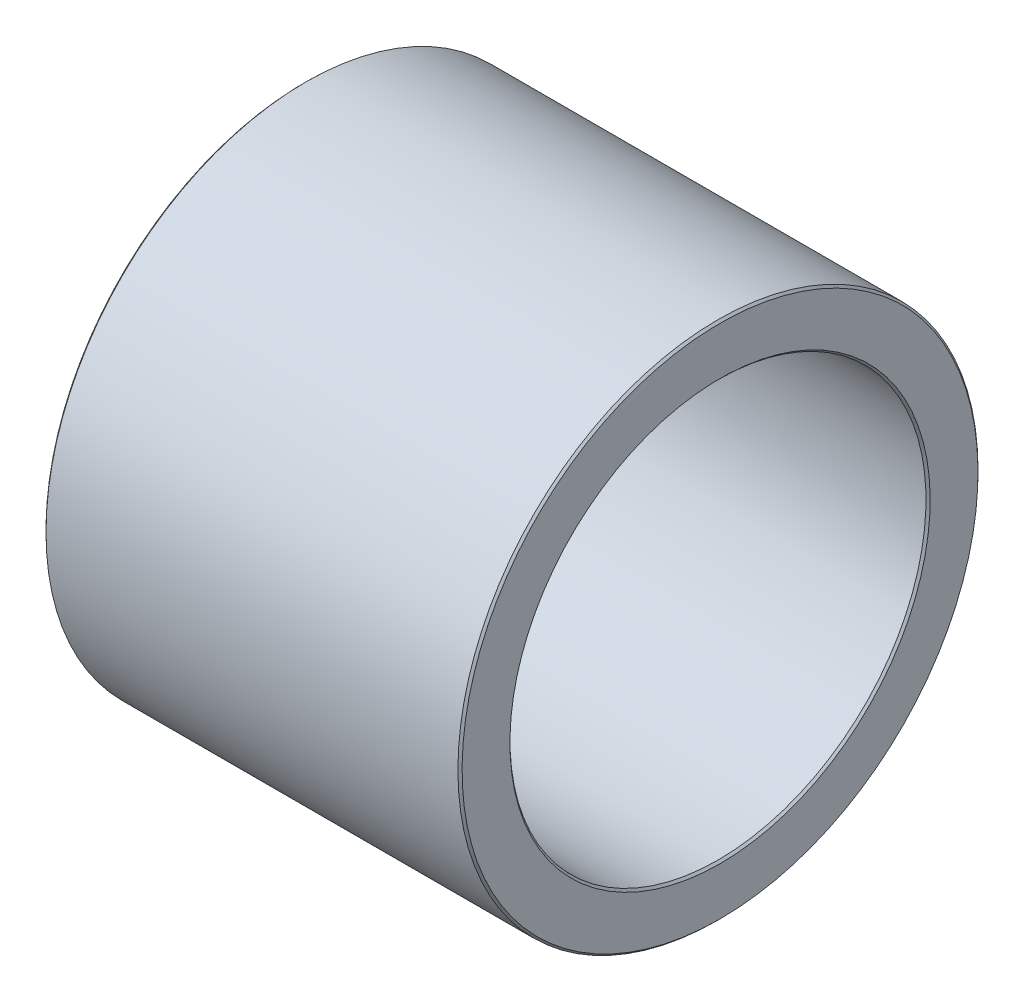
ISO-10303-21;
HEADER;
FILE_DESCRIPTION(('STEP AP214'),'2;1');
FILE_NAME('part.step','',(''),(''),'','','');
FILE_SCHEMA(('AUTOMOTIVE_DESIGN { 1 0 10303 214 1 1 1 1 }'));
ENDSEC;
DATA;
#1=APPLICATION_CONTEXT('core data for automotive mechanical design processes');
#2=APPLICATION_PROTOCOL_DEFINITION('international standard','automotive_design',2000,#1);
#3=PRODUCT_CONTEXT('',#1,'mechanical');
#4=PRODUCT('Part','Part','',(#3));
#5=PRODUCT_RELATED_PRODUCT_CATEGORY('part','',(#4));
#6=PRODUCT_DEFINITION_FORMATION('','',#4);
#7=PRODUCT_DEFINITION_CONTEXT('part definition',#1,'design');
#8=PRODUCT_DEFINITION('design','',#6,#7);
#9=PRODUCT_DEFINITION_SHAPE('','',#8);
#10=(LENGTH_UNIT() NAMED_UNIT(*) SI_UNIT(.MILLI.,.METRE.));
#11=(NAMED_UNIT(*) PLANE_ANGLE_UNIT() SI_UNIT($,.RADIAN.));
#12=(NAMED_UNIT(*) SI_UNIT($,.STERADIAN.) SOLID_ANGLE_UNIT());
#13=UNCERTAINTY_MEASURE_WITH_UNIT(LENGTH_MEASURE(1.E-05),#10,'distance_accuracy_value','');
#14=(GEOMETRIC_REPRESENTATION_CONTEXT(3) GLOBAL_UNCERTAINTY_ASSIGNED_CONTEXT((#13)) GLOBAL_UNIT_ASSIGNED_CONTEXT((#10,
#11,#12)) REPRESENTATION_CONTEXT('',''));
#15=CARTESIAN_POINT('',(0.,0.,0.));
#16=DIRECTION('',(0.,0.,1.));
#17=DIRECTION('',(1.,0.,0.));
#18=AXIS2_PLACEMENT_3D('',#15,#16,#17);
#19=CARTESIAN_POINT('',(0.,-45.,0.));
#20=DIRECTION('',(-1.,0.,0.));
#21=DIRECTION('',(0.,1.,0.));
#22=AXIS2_PLACEMENT_3D('',#19,#20,#21);
#23=PLANE('',#22);
#24=CARTESIAN_POINT('',(0.,0.,0.));
#25=DIRECTION('',(1.,0.,0.));
#26=DIRECTION('',(0.,-1.,0.));
#27=AXIS2_PLACEMENT_3D('',#24,#25,#26);
#28=CIRCLE('',#27,40.4);
#29=CARTESIAN_POINT('',(0.,-40.4,0.));
#30=VERTEX_POINT('',#29);
#31=EDGE_CURVE('E9',#30,#30,#28,.T.);
#32=ORIENTED_EDGE('',*,*,#31,.T.);
#33=EDGE_LOOP('',(#32));
#34=FACE_BOUND('',#33,.T.);
#35=CARTESIAN_POINT('',(0.,0.,0.));
#36=DIRECTION('',(1.,0.,0.));
#37=DIRECTION('',(0.,-1.,0.));
#38=AXIS2_PLACEMENT_3D('',#35,#36,#37);
#39=CIRCLE('',#38,49.6);
#40=CARTESIAN_POINT('',(0.,-49.6,0.));
#41=VERTEX_POINT('',#40);
#42=EDGE_CURVE('E55',#41,#41,#39,.T.);
#43=ORIENTED_EDGE('',*,*,#42,.F.);
#44=EDGE_LOOP('',(#43));
#45=FACE_BOUND('',#44,.T.);
#46=ADVANCED_FACE('F15',(#34,#45),#23,.T.);
#47=CARTESIAN_POINT('',(0.199999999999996,0.,0.));
#48=DIRECTION('',(-1.,0.,0.));
#49=DIRECTION('',(0.,-1.,0.));
#50=AXIS2_PLACEMENT_3D('',#47,#48,#49);
#51=CONICAL_SURFACE('',#50,40.2,0.785398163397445);
#52=CARTESIAN_POINT('',(0.4,0.,0.));
#53=DIRECTION('',(1.,0.,0.));
#54=DIRECTION('',(0.,-1.,0.));
#55=AXIS2_PLACEMENT_3D('',#52,#53,#54);
#56=CIRCLE('',#55,40.);
#57=CARTESIAN_POINT('',(0.4,-40.,0.));
#58=VERTEX_POINT('',#57);
#59=EDGE_CURVE('E19',#58,#58,#56,.T.);
#60=ORIENTED_EDGE('',*,*,#59,.T.);
#61=EDGE_LOOP('',(#60));
#62=FACE_BOUND('',#61,.T.);
#63=ORIENTED_EDGE('',*,*,#31,.F.);
#64=EDGE_LOOP('',(#63));
#65=FACE_BOUND('',#64,.T.);
#66=ADVANCED_FACE('F17',(#62,#65),#51,.F.);
#67=CARTESIAN_POINT('',(40.,0.,0.));
#68=DIRECTION('',(-1.,0.,0.));
#69=DIRECTION('',(0.,-1.,0.));
#70=AXIS2_PLACEMENT_3D('',#67,#68,#69);
#71=CYLINDRICAL_SURFACE('',#70,40.);
#72=CARTESIAN_POINT('',(79.6,0.,0.));
#73=DIRECTION('',(1.,0.,0.));
#74=DIRECTION('',(0.,-1.,0.));
#75=AXIS2_PLACEMENT_3D('',#72,#73,#74);
#76=CIRCLE('',#75,40.);
#77=CARTESIAN_POINT('',(79.6,-40.,0.));
#78=VERTEX_POINT('',#77);
#79=EDGE_CURVE('E60',#78,#78,#76,.T.);
#80=ORIENTED_EDGE('',*,*,#79,.T.);
#81=EDGE_LOOP('',(#80));
#82=FACE_BOUND('',#81,.T.);
#83=ORIENTED_EDGE('',*,*,#59,.F.);
#84=EDGE_LOOP('',(#83));
#85=FACE_BOUND('',#84,.T.);
#86=ADVANCED_FACE('F69',(#82,#85),#71,.F.);
#87=CARTESIAN_POINT('',(79.8,0.,0.));
#88=DIRECTION('',(1.,0.,0.));
#89=DIRECTION('',(0.,-1.,0.));
#90=AXIS2_PLACEMENT_3D('',#87,#88,#89);
#91=CONICAL_SURFACE('',#90,40.2,0.78539816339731);
#92=CARTESIAN_POINT('',(80.,0.,0.));
#93=DIRECTION('',(1.,0.,0.));
#94=DIRECTION('',(0.,-1.,0.));
#95=AXIS2_PLACEMENT_3D('',#92,#93,#94);
#96=CIRCLE('',#95,40.4);
#97=CARTESIAN_POINT('',(80.,-40.4,0.));
#98=VERTEX_POINT('',#97);
#99=EDGE_CURVE('E64',#98,#98,#96,.T.);
#100=ORIENTED_EDGE('',*,*,#99,.T.);
#101=EDGE_LOOP('',(#100));
#102=FACE_BOUND('',#101,.T.);
#103=ORIENTED_EDGE('',*,*,#79,.F.);
#104=EDGE_LOOP('',(#103));
#105=FACE_BOUND('',#104,.T.);
#106=ADVANCED_FACE('F72',(#102,#105),#91,.F.);
#107=CARTESIAN_POINT('',(80.,-45.,0.));
#108=DIRECTION('',(1.,0.,0.));
#109=DIRECTION('',(0.,-1.,0.));
#110=AXIS2_PLACEMENT_3D('',#107,#108,#109);
#111=PLANE('',#110);
#112=CARTESIAN_POINT('',(80.,0.,0.));
#113=DIRECTION('',(1.,0.,0.));
#114=DIRECTION('',(0.,-1.,0.));
#115=AXIS2_PLACEMENT_3D('',#112,#113,#114);
#116=CIRCLE('',#115,49.6);
#117=CARTESIAN_POINT('',(80.,-49.6,0.));
#118=VERTEX_POINT('',#117);
#119=EDGE_CURVE('E63',#118,#118,#116,.T.);
#120=ORIENTED_EDGE('',*,*,#119,.T.);
#121=EDGE_LOOP('',(#120));
#122=FACE_BOUND('',#121,.T.);
#123=ORIENTED_EDGE('',*,*,#99,.F.);
#124=EDGE_LOOP('',(#123));
#125=FACE_BOUND('',#124,.T.);
#126=ADVANCED_FACE('F74',(#122,#125),#111,.T.);
#127=CARTESIAN_POINT('',(79.8,0.,0.));
#128=DIRECTION('',(-1.,0.,0.));
#129=DIRECTION('',(0.,-1.,0.));
#130=AXIS2_PLACEMENT_3D('',#127,#128,#129);
#131=CONICAL_SURFACE('',#130,49.8,0.78539816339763);
#132=CARTESIAN_POINT('',(79.6,0.,0.));
#133=DIRECTION('',(1.,0.,0.));
#134=DIRECTION('',(0.,-1.,0.));
#135=AXIS2_PLACEMENT_3D('',#132,#133,#134);
#136=CIRCLE('',#135,50.);
#137=CARTESIAN_POINT('',(79.6,-50.,0.));
#138=VERTEX_POINT('',#137);
#139=EDGE_CURVE('E57',#138,#138,#136,.T.);
#140=ORIENTED_EDGE('',*,*,#139,.T.);
#141=EDGE_LOOP('',(#140));
#142=FACE_BOUND('',#141,.T.);
#143=ORIENTED_EDGE('',*,*,#119,.F.);
#144=EDGE_LOOP('',(#143));
#145=FACE_BOUND('',#144,.T.);
#146=ADVANCED_FACE('F81',(#142,#145),#131,.T.);
#147=CARTESIAN_POINT('',(40.,0.,0.));
#148=DIRECTION('',(-1.,0.,0.));
#149=DIRECTION('',(0.,-1.,0.));
#150=AXIS2_PLACEMENT_3D('',#147,#148,#149);
#151=CYLINDRICAL_SURFACE('',#150,50.);
#152=CARTESIAN_POINT('',(0.4,0.,0.));
#153=DIRECTION('',(1.,0.,0.));
#154=DIRECTION('',(0.,-1.,0.));
#155=AXIS2_PLACEMENT_3D('',#152,#153,#154);
#156=CIRCLE('',#155,50.);
#157=CARTESIAN_POINT('',(0.4,-50.,0.));
#158=VERTEX_POINT('',#157);
#159=EDGE_CURVE('E51',#158,#158,#156,.T.);
#160=ORIENTED_EDGE('',*,*,#159,.T.);
#161=EDGE_LOOP('',(#160));
#162=FACE_BOUND('',#161,.T.);
#163=ORIENTED_EDGE('',*,*,#139,.F.);
#164=EDGE_LOOP('',(#163));
#165=FACE_BOUND('',#164,.T.);
#166=ADVANCED_FACE('F52',(#162,#165),#151,.T.);
#167=CARTESIAN_POINT('',(0.200000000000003,0.,0.));
#168=DIRECTION('',(1.,0.,0.));
#169=DIRECTION('',(0.,-1.,0.));
#170=AXIS2_PLACEMENT_3D('',#167,#168,#169);
#171=CONICAL_SURFACE('',#170,49.8,0.785398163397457);
#172=ORIENTED_EDGE('',*,*,#42,.T.);
#173=EDGE_LOOP('',(#172));
#174=FACE_BOUND('',#173,.T.);
#175=ORIENTED_EDGE('',*,*,#159,.F.);
#176=EDGE_LOOP('',(#175));
#177=FACE_BOUND('',#176,.T.);
#178=ADVANCED_FACE('F93',(#174,#177),#171,.T.);
#179=CLOSED_SHELL('',(#46,#66,#86,#106,#126,#146,#166,#178));
#180=MANIFOLD_SOLID_BREP('B1',#179);
#181=ADVANCED_BREP_SHAPE_REPRESENTATION('',(#18,#180),#14);
#182=SHAPE_DEFINITION_REPRESENTATION(#9,#181);
ENDSEC;
END-ISO-10303-21;
